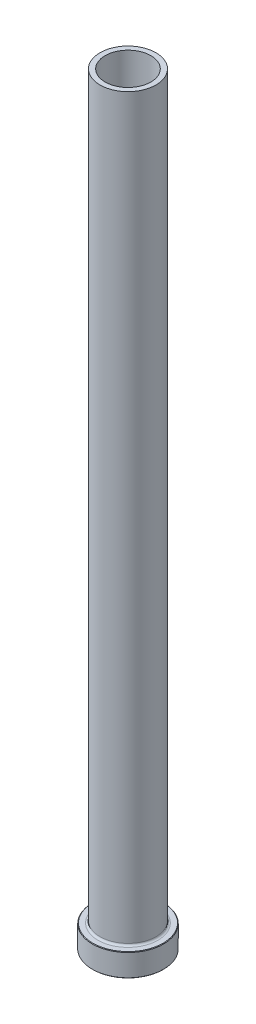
ISO-10303-21;
HEADER;
FILE_DESCRIPTION(('STEP AP214'),'2;1');
FILE_NAME('part.step','',(''),(''),'','','');
FILE_SCHEMA(('AUTOMOTIVE_DESIGN { 1 0 10303 214 1 1 1 1 }'));
ENDSEC;
DATA;
#1=APPLICATION_CONTEXT('core data for automotive mechanical design processes');
#2=APPLICATION_PROTOCOL_DEFINITION('international standard','automotive_design',2000,#1);
#3=PRODUCT_CONTEXT('',#1,'mechanical');
#4=PRODUCT('Part','Part','',(#3));
#5=PRODUCT_RELATED_PRODUCT_CATEGORY('part','',(#4));
#6=PRODUCT_DEFINITION_FORMATION('','',#4);
#7=PRODUCT_DEFINITION_CONTEXT('part definition',#1,'design');
#8=PRODUCT_DEFINITION('design','',#6,#7);
#9=PRODUCT_DEFINITION_SHAPE('','',#8);
#10=(LENGTH_UNIT() NAMED_UNIT(*) SI_UNIT(.MILLI.,.METRE.));
#11=(NAMED_UNIT(*) PLANE_ANGLE_UNIT() SI_UNIT($,.RADIAN.));
#12=(NAMED_UNIT(*) SI_UNIT($,.STERADIAN.) SOLID_ANGLE_UNIT());
#13=UNCERTAINTY_MEASURE_WITH_UNIT(LENGTH_MEASURE(1.E-05),#10,'distance_accuracy_value','');
#14=(GEOMETRIC_REPRESENTATION_CONTEXT(3) GLOBAL_UNCERTAINTY_ASSIGNED_CONTEXT((#13)) GLOBAL_UNIT_ASSIGNED_CONTEXT((#10,
#11,#12)) REPRESENTATION_CONTEXT('',''));
#15=CARTESIAN_POINT('',(0.,0.,0.));
#16=DIRECTION('',(0.,0.,1.));
#17=DIRECTION('',(1.,0.,0.));
#18=AXIS2_PLACEMENT_3D('',#15,#16,#17);
#19=CARTESIAN_POINT('',(0.,92.1876809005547,0.));
#20=DIRECTION('',(0.,1.,0.));
#21=DIRECTION('',(0.,0.,1.));
#22=AXIS2_PLACEMENT_3D('',#19,#20,#21);
#23=CYLINDRICAL_SURFACE('',#22,9.00000000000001);
#24=CARTESIAN_POINT('',(0.,300.,0.));
#25=DIRECTION('',(0.,1.,0.));
#26=DIRECTION('',(0.,0.,1.));
#27=AXIS2_PLACEMENT_3D('',#24,#25,#26);
#28=CIRCLE('',#27,9.00000000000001);
#29=CARTESIAN_POINT('',(0.,300.,9.00000000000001));
#30=VERTEX_POINT('',#29);
#31=EDGE_CURVE('E62',#30,#30,#28,.T.);
#32=ORIENTED_EDGE('',*,*,#31,.T.);
#33=EDGE_LOOP('',(#32));
#34=FACE_BOUND('',#33,.T.);
#35=CARTESIAN_POINT('',(0.,245.,0.));
#36=DIRECTION('',(0.,1.,0.));
#37=DIRECTION('',(0.,0.,1.));
#38=AXIS2_PLACEMENT_3D('',#35,#36,#37);
#39=CIRCLE('',#38,9.00000000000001);
#40=CARTESIAN_POINT('',(0.,245.,9.00000000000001));
#41=VERTEX_POINT('',#40);
#42=EDGE_CURVE('E71',#41,#41,#39,.T.);
#43=ORIENTED_EDGE('',*,*,#42,.F.);
#44=EDGE_LOOP('',(#43));
#45=FACE_BOUND('',#44,.T.);
#46=ADVANCED_FACE('F30',(#34,#45),#23,.F.);
#47=CARTESIAN_POINT('',(-9.00000000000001,300.,0.));
#48=DIRECTION('',(0.,1.,0.));
#49=DIRECTION('',(0.,0.,1.));
#50=AXIS2_PLACEMENT_3D('',#47,#48,#49);
#51=PLANE('',#50);
#52=CARTESIAN_POINT('',(0.,300.,0.));
#53=DIRECTION('',(0.,1.,0.));
#54=DIRECTION('',(0.,0.,1.));
#55=AXIS2_PLACEMENT_3D('',#52,#53,#54);
#56=CIRCLE('',#55,11.);
#57=CARTESIAN_POINT('',(0.,300.,11.));
#58=VERTEX_POINT('',#57);
#59=EDGE_CURVE('E65',#58,#58,#56,.T.);
#60=ORIENTED_EDGE('',*,*,#59,.T.);
#61=EDGE_LOOP('',(#60));
#62=FACE_BOUND('',#61,.T.);
#63=ORIENTED_EDGE('',*,*,#31,.F.);
#64=EDGE_LOOP('',(#63));
#65=FACE_BOUND('',#64,.T.);
#66=ADVANCED_FACE('F79',(#62,#65),#51,.T.);
#67=CARTESIAN_POINT('',(0.,92.1876809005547,0.));
#68=DIRECTION('',(0.,1.,0.));
#69=DIRECTION('',(0.,0.,1.));
#70=AXIS2_PLACEMENT_3D('',#67,#68,#69);
#71=CYLINDRICAL_SURFACE('',#70,11.);
#72=CARTESIAN_POINT('',(0.,9.8,0.));
#73=DIRECTION('',(0.,1.,0.));
#74=DIRECTION('',(0.,0.,1.));
#75=AXIS2_PLACEMENT_3D('',#72,#73,#74);
#76=CIRCLE('',#75,11.);
#77=CARTESIAN_POINT('',(0.,9.8,11.));
#78=VERTEX_POINT('',#77);
#79=EDGE_CURVE('E59',#78,#78,#76,.T.);
#80=ORIENTED_EDGE('',*,*,#79,.T.);
#81=EDGE_LOOP('',(#80));
#82=FACE_BOUND('',#81,.T.);
#83=ORIENTED_EDGE('',*,*,#59,.F.);
#84=EDGE_LOOP('',(#83));
#85=FACE_BOUND('',#84,.T.);
#86=ADVANCED_FACE('F85',(#82,#85),#71,.T.);
#87=CARTESIAN_POINT('',(-11.,9.,0.));
#88=DIRECTION('',(0.,1.,0.));
#89=DIRECTION('',(0.,0.,1.));
#90=AXIS2_PLACEMENT_3D('',#87,#88,#89);
#91=PLANE('',#90);
#92=CARTESIAN_POINT('',(0.,9.,0.));
#93=DIRECTION('',(0.,1.,0.));
#94=DIRECTION('',(0.,0.,1.));
#95=AXIS2_PLACEMENT_3D('',#92,#93,#94);
#96=CIRCLE('',#95,13.7999999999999);
#97=CARTESIAN_POINT('',(0.,9.,13.7999999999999));
#98=VERTEX_POINT('',#97);
#99=EDGE_CURVE('E53',#98,#98,#96,.T.);
#100=ORIENTED_EDGE('',*,*,#99,.T.);
#101=EDGE_LOOP('',(#100));
#102=FACE_BOUND('',#101,.T.);
#103=CARTESIAN_POINT('',(0.,9.,0.));
#104=DIRECTION('',(0.,1.,0.));
#105=DIRECTION('',(0.,0.,1.));
#106=AXIS2_PLACEMENT_3D('',#103,#104,#105);
#107=CIRCLE('',#106,11.8);
#108=CARTESIAN_POINT('',(0.,9.,11.8));
#109=VERTEX_POINT('',#108);
#110=EDGE_CURVE('E56',#109,#109,#107,.F.);
#111=ORIENTED_EDGE('',*,*,#110,.T.);
#112=EDGE_LOOP('',(#111));
#113=FACE_BOUND('',#112,.T.);
#114=ADVANCED_FACE('F111',(#102,#113),#91,.T.);
#115=CARTESIAN_POINT('',(0.,92.1876809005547,0.));
#116=DIRECTION('',(0.,1.,0.));
#117=DIRECTION('',(0.,0.,1.));
#118=AXIS2_PLACEMENT_3D('',#115,#116,#117);
#119=CYLINDRICAL_SURFACE('',#118,14.);
#120=CARTESIAN_POINT('',(0.,8.79999999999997,0.));
#121=DIRECTION('',(0.,1.,0.));
#122=DIRECTION('',(0.,0.,1.));
#123=AXIS2_PLACEMENT_3D('',#120,#121,#122);
#124=CIRCLE('',#123,14.);
#125=CARTESIAN_POINT('',(0.,8.79999999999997,14.));
#126=VERTEX_POINT('',#125);
#127=EDGE_CURVE('E45',#126,#126,#124,.F.);
#128=ORIENTED_EDGE('',*,*,#127,.T.);
#129=EDGE_LOOP('',(#128));
#130=FACE_BOUND('',#129,.T.);
#131=CARTESIAN_POINT('',(0.,0.199999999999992,0.));
#132=DIRECTION('',(0.,-1.,0.));
#133=DIRECTION('',(0.,0.,-1.));
#134=AXIS2_PLACEMENT_3D('',#131,#132,#133);
#135=CIRCLE('',#134,14.);
#136=CARTESIAN_POINT('',(0.,0.199999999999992,-14.));
#137=VERTEX_POINT('',#136);
#138=EDGE_CURVE('E50',#137,#137,#135,.F.);
#139=ORIENTED_EDGE('',*,*,#138,.T.);
#140=EDGE_LOOP('',(#139));
#141=FACE_BOUND('',#140,.T.);
#142=ADVANCED_FACE('F108',(#130,#141),#119,.T.);
#143=CARTESIAN_POINT('',(-14.,0.,0.));
#144=DIRECTION('',(0.,-1.,0.));
#145=DIRECTION('',(0.,0.,-1.));
#146=AXIS2_PLACEMENT_3D('',#143,#144,#145);
#147=PLANE('',#146);
#148=CARTESIAN_POINT('',(0.,0.,0.));
#149=DIRECTION('',(0.,-1.,0.));
#150=DIRECTION('',(0.,0.,-1.));
#151=AXIS2_PLACEMENT_3D('',#148,#149,#150);
#152=CIRCLE('',#151,9.74999999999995);
#153=CARTESIAN_POINT('',(0.,0.,-9.74999999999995));
#154=VERTEX_POINT('',#153);
#155=EDGE_CURVE('E37',#154,#154,#152,.F.);
#156=ORIENTED_EDGE('',*,*,#155,.T.);
#157=EDGE_LOOP('',(#156));
#158=FACE_BOUND('',#157,.T.);
#159=CARTESIAN_POINT('',(0.,0.,0.));
#160=DIRECTION('',(0.,-1.,0.));
#161=DIRECTION('',(0.,0.,-1.));
#162=AXIS2_PLACEMENT_3D('',#159,#160,#161);
#163=CIRCLE('',#162,13.8);
#164=CARTESIAN_POINT('',(0.,0.,-13.8));
#165=VERTEX_POINT('',#164);
#166=EDGE_CURVE('E41',#165,#165,#163,.T.);
#167=ORIENTED_EDGE('',*,*,#166,.T.);
#168=EDGE_LOOP('',(#167));
#169=FACE_BOUND('',#168,.T.);
#170=ADVANCED_FACE('F110',(#158,#169),#147,.T.);
#171=CARTESIAN_POINT('',(0.,92.1876809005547,0.));
#172=DIRECTION('',(0.,1.,0.));
#173=DIRECTION('',(0.,0.,1.));
#174=AXIS2_PLACEMENT_3D('',#171,#172,#173);
#175=CYLINDRICAL_SURFACE('',#174,9.25000000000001);
#176=CARTESIAN_POINT('',(0.,0.499999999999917,0.));
#177=DIRECTION('',(0.,-1.,0.));
#178=DIRECTION('',(0.,0.,-1.));
#179=AXIS2_PLACEMENT_3D('',#176,#177,#178);
#180=CIRCLE('',#179,9.25000000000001);
#181=CARTESIAN_POINT('',(0.,0.499999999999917,-9.25000000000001));
#182=VERTEX_POINT('',#181);
#183=EDGE_CURVE('E10',#182,#182,#180,.T.);
#184=ORIENTED_EDGE('',*,*,#183,.T.);
#185=EDGE_LOOP('',(#184));
#186=FACE_BOUND('',#185,.T.);
#187=CARTESIAN_POINT('',(0.,233.,0.));
#188=DIRECTION('',(0.,1.,0.));
#189=DIRECTION('',(0.,0.,1.));
#190=AXIS2_PLACEMENT_3D('',#187,#188,#189);
#191=CIRCLE('',#190,9.25000000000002);
#192=CARTESIAN_POINT('',(0.,233.,9.25000000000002));
#193=VERTEX_POINT('',#192);
#194=EDGE_CURVE('E68',#193,#193,#191,.T.);
#195=ORIENTED_EDGE('',*,*,#194,.T.);
#196=EDGE_LOOP('',(#195));
#197=FACE_BOUND('',#196,.T.);
#198=ADVANCED_FACE('F118',(#186,#197),#175,.F.);
#199=CARTESIAN_POINT('',(0.,233.,0.));
#200=DIRECTION('',(0.,-1.,0.));
#201=DIRECTION('',(0.,0.,-1.));
#202=AXIS2_PLACEMENT_3D('',#199,#200,#201);
#203=CONICAL_SURFACE('',#202,9.25000000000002,0.0208303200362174);
#204=ORIENTED_EDGE('',*,*,#42,.T.);
#205=EDGE_LOOP('',(#204));
#206=FACE_BOUND('',#205,.T.);
#207=ORIENTED_EDGE('',*,*,#194,.F.);
#208=EDGE_LOOP('',(#207));
#209=FACE_BOUND('',#208,.T.);
#210=ADVANCED_FACE('F75',(#206,#209),#203,.F.);
#211=CARTESIAN_POINT('',(0.,9.8,0.));
#212=DIRECTION('',(0.,1.,0.));
#213=DIRECTION('',(0.,0.,1.));
#214=AXIS2_PLACEMENT_3D('',#211,#212,#213);
#215=TOROIDAL_SURFACE('',#214,11.8,0.8);
#216=ORIENTED_EDGE('',*,*,#110,.F.);
#217=EDGE_LOOP('',(#216));
#218=FACE_BOUND('',#217,.T.);
#219=ORIENTED_EDGE('',*,*,#79,.F.);
#220=EDGE_LOOP('',(#219));
#221=FACE_BOUND('',#220,.T.);
#222=ADVANCED_FACE('F90',(#218,#221),#215,.F.);
#223=CARTESIAN_POINT('',(0.,8.99999999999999,0.));
#224=DIRECTION('',(0.,-1.,0.));
#225=DIRECTION('',(0.,0.,-1.));
#226=AXIS2_PLACEMENT_3D('',#223,#224,#225);
#227=CONICAL_SURFACE('',#226,13.7999999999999,0.785398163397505);
#228=ORIENTED_EDGE('',*,*,#127,.F.);
#229=EDGE_LOOP('',(#228));
#230=FACE_BOUND('',#229,.T.);
#231=ORIENTED_EDGE('',*,*,#99,.F.);
#232=EDGE_LOOP('',(#231));
#233=FACE_BOUND('',#232,.T.);
#234=ADVANCED_FACE('F93',(#230,#233),#227,.T.);
#235=CARTESIAN_POINT('',(0.,0.199999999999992,0.));
#236=DIRECTION('',(0.,1.,0.));
#237=DIRECTION('',(0.,0.,1.));
#238=AXIS2_PLACEMENT_3D('',#235,#236,#237);
#239=CONICAL_SURFACE('',#238,14.,0.785398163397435);
#240=ORIENTED_EDGE('',*,*,#166,.F.);
#241=EDGE_LOOP('',(#240));
#242=FACE_BOUND('',#241,.T.);
#243=ORIENTED_EDGE('',*,*,#138,.F.);
#244=EDGE_LOOP('',(#243));
#245=FACE_BOUND('',#244,.T.);
#246=ADVANCED_FACE('F96',(#242,#245),#239,.T.);
#247=CARTESIAN_POINT('',(0.,0.,0.));
#248=DIRECTION('',(0.,-1.,0.));
#249=DIRECTION('',(0.,0.,-1.));
#250=AXIS2_PLACEMENT_3D('',#247,#248,#249);
#251=CONICAL_SURFACE('',#250,9.74999999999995,0.78539816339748);
#252=ORIENTED_EDGE('',*,*,#183,.F.);
#253=EDGE_LOOP('',(#252));
#254=FACE_BOUND('',#253,.T.);
#255=ORIENTED_EDGE('',*,*,#155,.F.);
#256=EDGE_LOOP('',(#255));
#257=FACE_BOUND('',#256,.T.);
#258=ADVANCED_FACE('F32',(#254,#257),#251,.F.);
#259=CLOSED_SHELL('',(#46,#66,#86,#114,#142,#170,#198,#210,#222,#234,#246,#258));
#260=MANIFOLD_SOLID_BREP('B2',#259);
#261=ADVANCED_BREP_SHAPE_REPRESENTATION('',(#18,#260),#14);
#262=SHAPE_DEFINITION_REPRESENTATION(#9,#261);
ENDSEC;
END-ISO-10303-21;
